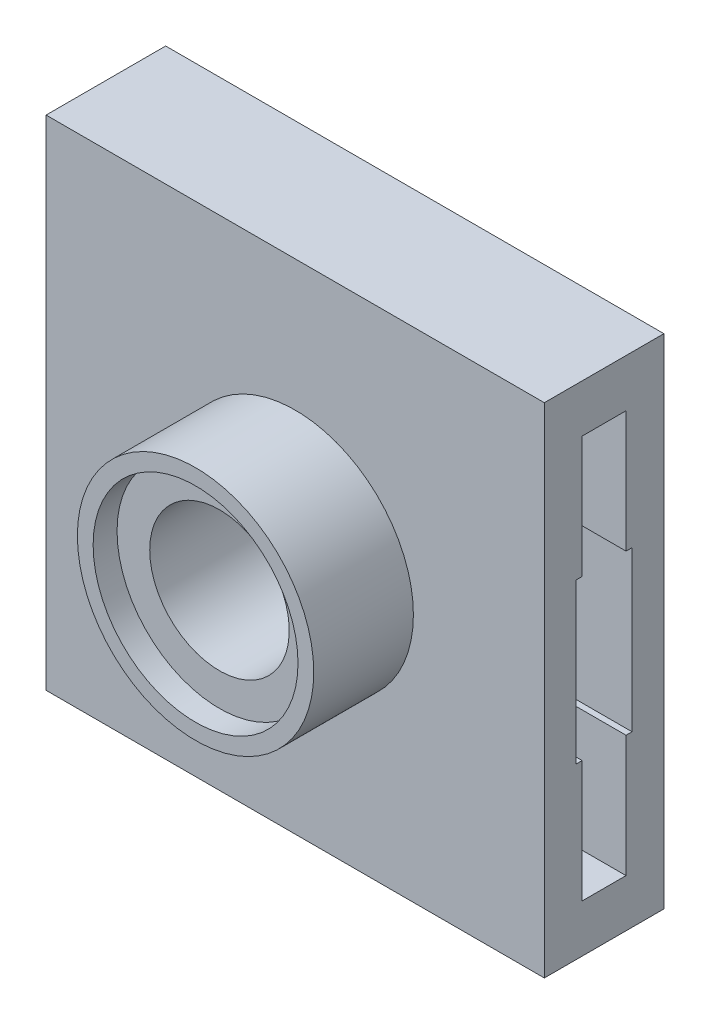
from build123d import *

# Parameters (mm, degrees)
SKETCH2_W               = 12.5
SKETCH2_H               = 12.5
BOSS_EXTRUDE1_DEPTH     = 3
SKETCH3_R               = 2.965
SKETCH3_R_2             = 1.75
BOSS_EXTRUDE2_DEPTH     = 2.5
CUT_EXTRUDE1_START      = 1.5
SKETCH4_R               = 1.75
CUT_EXTRUDE1_DEPTH      = 1.5
CUT_EXTRUDE3_DEPTH      = 0.55
CUT_EXTRUDE3_DEPTH_BACK = 0.55
SKETCH12_W              = 11.3
SKETCH12_H              = 10.1
CUT_EXTRUDE4_DEPTH      = 0.7
CUT_EXTRUDE4_DEPTH_BACK = 0.7
SKETCH14_W              = 9.5
SKETCH14_H              = 4
SKETCH15_W              = 1.1
SKETCH15_H              = 7
CUT_EXTRUDE5_DEPTH      = 1.2
SKETCH17_R              = 2.57
CUT_EXTRUDE6_DEPTH      = 0.6


with BuildPart() as part:
    # Sketch2 → Boss-Extrude1 (new body)
    with BuildSketch(Plane.XY):
        Rectangle(SKETCH2_W, SKETCH2_H)
    extrude(amount=BOSS_EXTRUDE1_DEPTH)

    # Sketch3 → Boss-Extrude2 (add)
    with BuildSketch(Plane.XY):
        Circle(SKETCH3_R)
        Circle(SKETCH3_R_2, mode=Mode.SUBTRACT)
    boss_extrude2 = extrude(amount=-BOSS_EXTRUDE2_DEPTH)

    # Sketch4 → Cut-Extrude1 (cut)
    with BuildSketch(Plane.XY.offset(CUT_EXTRUDE1_START)):
        Circle(SKETCH4_R)
    cut_extrude1 = extrude(amount=-CUT_EXTRUDE1_DEPTH, mode=Mode.SUBTRACT)

    # Mirror2: Boss-Extrude2, Cut-Extrude1 across plane
    add(boss_extrude2.mirror(Plane.XY.offset(1.5)))
    add(cut_extrude1.mirror(Plane.XY.offset(1.5)), mode=Mode.SUBTRACT)

    # Sketch12 → Cut-Extrude3 (cut, two sides: drawn at the far end of the back side and taken through both)
    with BuildSketch(Plane.XY.offset(1.5).offset(-CUT_EXTRUDE3_DEPTH_BACK)):
        with Locations((0.6, 0)):
            Rectangle(SKETCH12_W, SKETCH12_H)
    extrude(amount=CUT_EXTRUDE3_DEPTH + CUT_EXTRUDE3_DEPTH_BACK, mode=Mode.SUBTRACT)

    # Sketch14 → Cut-Extrude4 (cut, two sides: drawn at the far end of the back side and taken through both)
    with BuildSketch(Plane.XY.offset(1.5).offset(-CUT_EXTRUDE4_DEPTH_BACK)):
        with Locations((1.5, 0)):
            Rectangle(SKETCH14_W, SKETCH14_H)
    extrude(amount=CUT_EXTRUDE4_DEPTH + CUT_EXTRUDE4_DEPTH_BACK, mode=Mode.SUBTRACT)

    # Sketch15 → Cut-Extrude5 (cut)
    with BuildSketch(Plane(origin=(-6.25, 0, 0), x_dir=(0, 0, -1), z_dir=(1, 0, 0))):
        with Locations((-1.5, 0)):
            Rectangle(SKETCH15_W, SKETCH15_H)
    extrude(amount=CUT_EXTRUDE5_DEPTH, mode=Mode.SUBTRACT)

    # Sketch17 → Cut-Extrude6 (cut)
    with BuildSketch(Plane.XY.offset(-2.5)):
        Circle(SKETCH17_R)
    cut_extrude6 = extrude(amount=CUT_EXTRUDE6_DEPTH, mode=Mode.SUBTRACT)

    # Mirror3: Cut-Extrude6 across plane
    add(cut_extrude6.mirror(Plane.XY.offset(1.5)), mode=Mode.SUBTRACT)


solid = part.part
